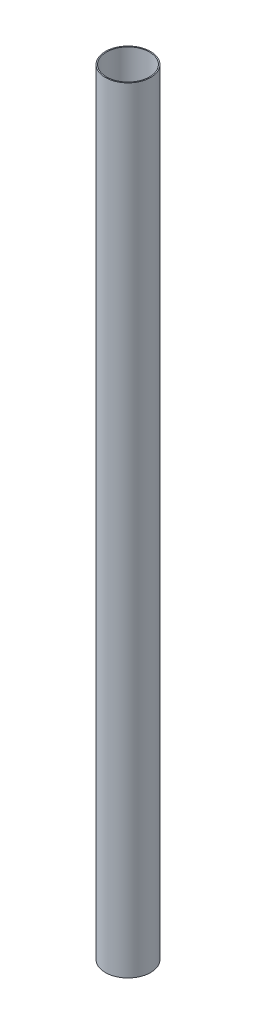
ISO-10303-21;
HEADER;
FILE_DESCRIPTION(('STEP AP214'),'2;1');
FILE_NAME('part.step','',(''),(''),'','','');
FILE_SCHEMA(('AUTOMOTIVE_DESIGN { 1 0 10303 214 1 1 1 1 }'));
ENDSEC;
DATA;
#1=APPLICATION_CONTEXT('core data for automotive mechanical design processes');
#2=APPLICATION_PROTOCOL_DEFINITION('international standard','automotive_design',2000,#1);
#3=PRODUCT_CONTEXT('',#1,'mechanical');
#4=PRODUCT('Part','Part','',(#3));
#5=PRODUCT_RELATED_PRODUCT_CATEGORY('part','',(#4));
#6=PRODUCT_DEFINITION_FORMATION('','',#4);
#7=PRODUCT_DEFINITION_CONTEXT('part definition',#1,'design');
#8=PRODUCT_DEFINITION('design','',#6,#7);
#9=PRODUCT_DEFINITION_SHAPE('','',#8);
#10=(LENGTH_UNIT() NAMED_UNIT(*) SI_UNIT(.MILLI.,.METRE.));
#11=(NAMED_UNIT(*) PLANE_ANGLE_UNIT() SI_UNIT($,.RADIAN.));
#12=(NAMED_UNIT(*) SI_UNIT($,.STERADIAN.) SOLID_ANGLE_UNIT());
#13=UNCERTAINTY_MEASURE_WITH_UNIT(LENGTH_MEASURE(1.E-05),#10,'distance_accuracy_value','');
#14=(GEOMETRIC_REPRESENTATION_CONTEXT(3) GLOBAL_UNCERTAINTY_ASSIGNED_CONTEXT((#13)) GLOBAL_UNIT_ASSIGNED_CONTEXT((#10,
#11,#12)) REPRESENTATION_CONTEXT('',''));
#15=CARTESIAN_POINT('',(0.,0.,0.));
#16=DIRECTION('',(0.,0.,1.));
#17=DIRECTION('',(1.,0.,0.));
#18=AXIS2_PLACEMENT_3D('',#15,#16,#17);
#19=CARTESIAN_POINT('',(0.,1828.8,0.));
#20=DIRECTION('',(0.,1.,0.));
#21=DIRECTION('',(0.,0.,1.));
#22=AXIS2_PLACEMENT_3D('',#19,#20,#21);
#23=PLANE('',#22);
#24=CARTESIAN_POINT('',(0.,1828.8,0.));
#25=DIRECTION('',(0.,1.,0.));
#26=DIRECTION('',(0.,0.,1.));
#27=AXIS2_PLACEMENT_3D('',#24,#25,#26);
#28=CIRCLE('',#27,53.34);
#29=CARTESIAN_POINT('',(0.,1828.8,53.34));
#30=VERTEX_POINT('',#29);
#31=EDGE_CURVE('E10',#30,#30,#28,.T.);
#32=ORIENTED_EDGE('',*,*,#31,.T.);
#33=EDGE_LOOP('',(#32));
#34=FACE_BOUND('',#33,.T.);
#35=CARTESIAN_POINT('',(0.,1828.8,0.));
#36=DIRECTION('',(0.,1.,0.));
#37=DIRECTION('',(0.,0.,1.));
#38=AXIS2_PLACEMENT_3D('',#35,#36,#37);
#39=CIRCLE('',#38,50.8);
#40=CARTESIAN_POINT('',(0.,1828.8,50.8));
#41=VERTEX_POINT('',#40);
#42=EDGE_CURVE('E43',#41,#41,#39,.T.);
#43=ORIENTED_EDGE('',*,*,#42,.F.);
#44=EDGE_LOOP('',(#43));
#45=FACE_BOUND('',#44,.T.);
#46=ADVANCED_FACE('F32',(#34,#45),#23,.T.);
#47=CARTESIAN_POINT('',(0.,0.,0.));
#48=DIRECTION('',(0.,1.,0.));
#49=DIRECTION('',(0.,0.,1.));
#50=AXIS2_PLACEMENT_3D('',#47,#48,#49);
#51=PLANE('',#50);
#52=CARTESIAN_POINT('',(0.,0.,0.));
#53=DIRECTION('',(0.,1.,0.));
#54=DIRECTION('',(0.,0.,1.));
#55=AXIS2_PLACEMENT_3D('',#52,#53,#54);
#56=CIRCLE('',#55,53.34);
#57=CARTESIAN_POINT('',(0.,0.,53.34));
#58=VERTEX_POINT('',#57);
#59=EDGE_CURVE('E39',#58,#58,#56,.T.);
#60=ORIENTED_EDGE('',*,*,#59,.F.);
#61=EDGE_LOOP('',(#60));
#62=FACE_BOUND('',#61,.T.);
#63=CARTESIAN_POINT('',(0.,0.,0.));
#64=DIRECTION('',(0.,1.,0.));
#65=DIRECTION('',(0.,0.,1.));
#66=AXIS2_PLACEMENT_3D('',#63,#64,#65);
#67=CIRCLE('',#66,50.8);
#68=CARTESIAN_POINT('',(0.,0.,50.8));
#69=VERTEX_POINT('',#68);
#70=EDGE_CURVE('E47',#69,#69,#67,.T.);
#71=ORIENTED_EDGE('',*,*,#70,.T.);
#72=EDGE_LOOP('',(#71));
#73=FACE_BOUND('',#72,.T.);
#74=ADVANCED_FACE('F53',(#62,#73),#51,.F.);
#75=CARTESIAN_POINT('',(0.,1828.8,0.));
#76=DIRECTION('',(0.,-1.,0.));
#77=DIRECTION('',(0.,0.,-1.));
#78=AXIS2_PLACEMENT_3D('',#75,#76,#77);
#79=CYLINDRICAL_SURFACE('',#78,53.34);
#80=ORIENTED_EDGE('',*,*,#31,.F.);
#81=EDGE_LOOP('',(#80));
#82=FACE_BOUND('',#81,.T.);
#83=ORIENTED_EDGE('',*,*,#59,.T.);
#84=EDGE_LOOP('',(#83));
#85=FACE_BOUND('',#84,.T.);
#86=ADVANCED_FACE('F34',(#82,#85),#79,.T.);
#87=CARTESIAN_POINT('',(0.,1828.8,0.));
#88=DIRECTION('',(0.,-1.,0.));
#89=DIRECTION('',(0.,0.,-1.));
#90=AXIS2_PLACEMENT_3D('',#87,#88,#89);
#91=CYLINDRICAL_SURFACE('',#90,50.8);
#92=ORIENTED_EDGE('',*,*,#42,.T.);
#93=EDGE_LOOP('',(#92));
#94=FACE_BOUND('',#93,.T.);
#95=ORIENTED_EDGE('',*,*,#70,.F.);
#96=EDGE_LOOP('',(#95));
#97=FACE_BOUND('',#96,.T.);
#98=ADVANCED_FACE('F55',(#94,#97),#91,.F.);
#99=CLOSED_SHELL('',(#46,#74,#86,#98));
#100=MANIFOLD_SOLID_BREP('B2',#99);
#101=ADVANCED_BREP_SHAPE_REPRESENTATION('',(#18,#100),#14);
#102=SHAPE_DEFINITION_REPRESENTATION(#9,#101);
ENDSEC;
END-ISO-10303-21;
